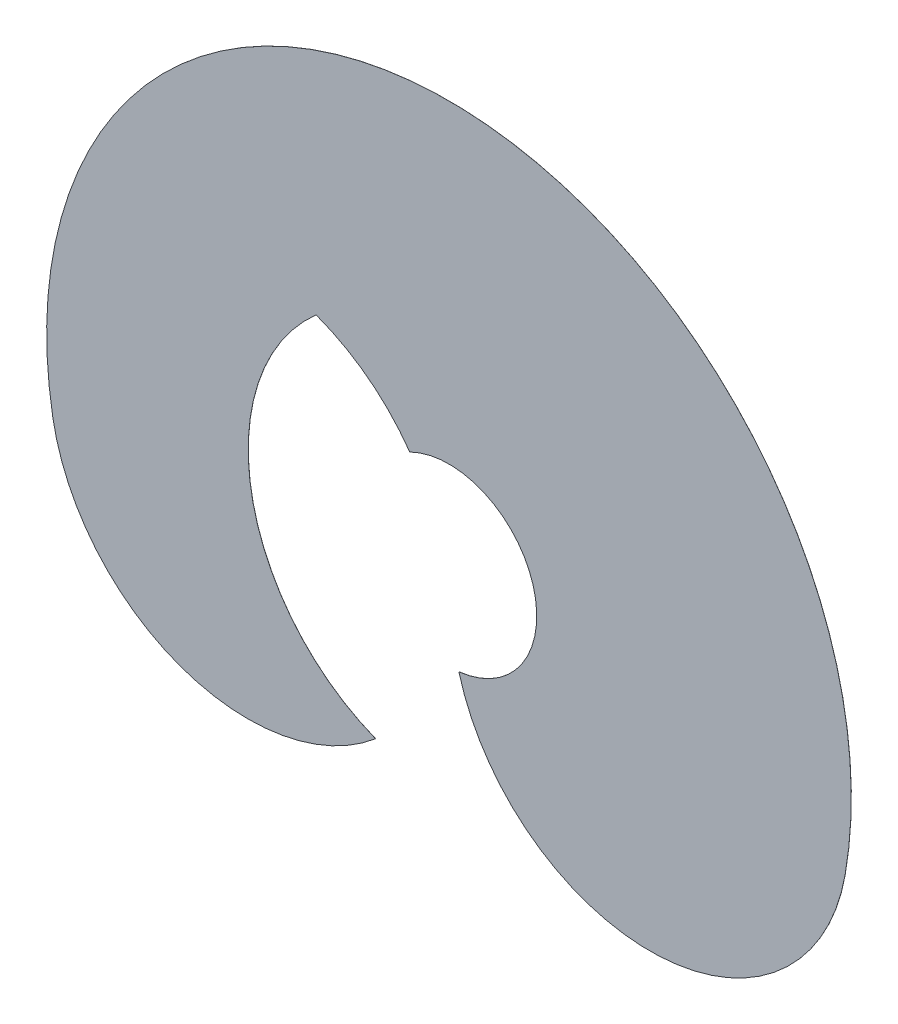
ISO-10303-21;
HEADER;
FILE_DESCRIPTION(('STEP AP214'),'2;1');
FILE_NAME('part.step','',(''),(''),'','','');
FILE_SCHEMA(('AUTOMOTIVE_DESIGN { 1 0 10303 214 1 1 1 1 }'));
ENDSEC;
DATA;
#1=APPLICATION_CONTEXT('core data for automotive mechanical design processes');
#2=APPLICATION_PROTOCOL_DEFINITION('international standard','automotive_design',2000,#1);
#3=PRODUCT_CONTEXT('',#1,'mechanical');
#4=PRODUCT('Part','Part','',(#3));
#5=PRODUCT_RELATED_PRODUCT_CATEGORY('part','',(#4));
#6=PRODUCT_DEFINITION_FORMATION('','',#4);
#7=PRODUCT_DEFINITION_CONTEXT('part definition',#1,'design');
#8=PRODUCT_DEFINITION('design','',#6,#7);
#9=PRODUCT_DEFINITION_SHAPE('','',#8);
#10=(LENGTH_UNIT() NAMED_UNIT(*) SI_UNIT(.MILLI.,.METRE.));
#11=(NAMED_UNIT(*) PLANE_ANGLE_UNIT() SI_UNIT($,.RADIAN.));
#12=(NAMED_UNIT(*) SI_UNIT($,.STERADIAN.) SOLID_ANGLE_UNIT());
#13=UNCERTAINTY_MEASURE_WITH_UNIT(LENGTH_MEASURE(1.E-05),#10,'distance_accuracy_value','');
#14=(GEOMETRIC_REPRESENTATION_CONTEXT(3) GLOBAL_UNCERTAINTY_ASSIGNED_CONTEXT((#13)) GLOBAL_UNIT_ASSIGNED_CONTEXT((#10,
#11,#12)) REPRESENTATION_CONTEXT('',''));
#15=CARTESIAN_POINT('',(0.,0.,0.));
#16=DIRECTION('',(0.,0.,1.));
#17=DIRECTION('',(1.,0.,0.));
#18=AXIS2_PLACEMENT_3D('',#15,#16,#17);
#19=CARTESIAN_POINT('',(250.,610.5,0.5));
#20=DIRECTION('',(0.,0.,-1.));
#21=DIRECTION('',(-1.,0.,0.));
#22=AXIS2_PLACEMENT_3D('',#19,#20,#21);
#23=CYLINDRICAL_SURFACE('',#22,1150.15105236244);
#24=CARTESIAN_POINT('',(250.,610.5,0.));
#25=DIRECTION('',(0.,0.,-1.));
#26=DIRECTION('',(1.,0.,0.));
#27=AXIS2_PLACEMENT_3D('',#24,#25,#26);
#28=CIRCLE('',#27,1150.15105236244);
#29=CARTESIAN_POINT('',(-170.519990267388,-460.018743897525,0.));
#30=VERTEX_POINT('',#29);
#31=CARTESIAN_POINT('',(-511.298505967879,1472.63225671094,0.));
#32=VERTEX_POINT('',#31);
#33=EDGE_CURVE('E117',#30,#32,#28,.T.);
#34=ORIENTED_EDGE('',*,*,#33,.T.);
#35=DIRECTION('',(0.,0.,-1.));
#36=VECTOR('',#35,1.);
#37=CARTESIAN_POINT('',(-511.298505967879,1472.63225671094,0.5));
#38=LINE('',#37,#36);
#39=CARTESIAN_POINT('',(-511.298505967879,1472.63225671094,0.5));
#40=VERTEX_POINT('',#39);
#41=EDGE_CURVE('E11',#40,#32,#38,.T.);
#42=ORIENTED_EDGE('',*,*,#41,.F.);
#43=CARTESIAN_POINT('',(250.,610.5,0.5));
#44=DIRECTION('',(0.,0.,-1.));
#45=DIRECTION('',(1.,0.,0.));
#46=AXIS2_PLACEMENT_3D('',#43,#44,#45);
#47=CIRCLE('',#46,1150.15105236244);
#48=CARTESIAN_POINT('',(-170.519990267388,-460.018743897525,0.5));
#49=VERTEX_POINT('',#48);
#50=EDGE_CURVE('E127',#49,#40,#47,.T.);
#51=ORIENTED_EDGE('',*,*,#50,.F.);
#52=DIRECTION('',(0.,0.,-1.));
#53=VECTOR('',#52,1.);
#54=CARTESIAN_POINT('',(-170.519990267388,-460.018743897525,0.5));
#55=LINE('',#54,#53);
#56=EDGE_CURVE('E113',#49,#30,#55,.T.);
#57=ORIENTED_EDGE('',*,*,#56,.T.);
#58=EDGE_LOOP('',(#34,#42,#51,#57));
#59=FACE_BOUND('',#58,.T.);
#60=ADVANCED_FACE('F33',(#59),#23,.F.);
#61=CARTESIAN_POINT('',(-902.225071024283,407.331632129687,0.5));
#62=DIRECTION('',(0.,0.,-1.));
#63=DIRECTION('',(-1.,0.,0.));
#64=AXIS2_PLACEMENT_3D('',#61,#62,#63);
#65=CYLINDRICAL_SURFACE('',#64,1134.76385208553);
#66=CARTESIAN_POINT('',(-902.225071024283,407.331632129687,0.));
#67=DIRECTION('',(0.,0.,-1.));
#68=DIRECTION('',(1.,0.,0.));
#69=AXIS2_PLACEMENT_3D('',#66,#67,#68);
#70=CIRCLE('',#69,1134.76385208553);
#71=CARTESIAN_POINT('',(25.5970747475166,1060.65778790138,0.));
#72=VERTEX_POINT('',#71);
#73=EDGE_CURVE('E120',#32,#72,#70,.T.);
#74=ORIENTED_EDGE('',*,*,#73,.T.);
#75=DIRECTION('',(0.,0.,-1.));
#76=VECTOR('',#75,1.);
#77=CARTESIAN_POINT('',(25.5970747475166,1060.65778790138,0.5));
#78=LINE('',#77,#76);
#79=CARTESIAN_POINT('',(25.5970747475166,1060.65778790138,0.5));
#80=VERTEX_POINT('',#79);
#81=EDGE_CURVE('E41',#80,#72,#78,.T.);
#82=ORIENTED_EDGE('',*,*,#81,.F.);
#83=CARTESIAN_POINT('',(-902.225071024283,407.331632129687,0.5));
#84=DIRECTION('',(0.,0.,-1.));
#85=DIRECTION('',(1.,0.,0.));
#86=AXIS2_PLACEMENT_3D('',#83,#84,#85);
#87=CIRCLE('',#86,1134.76385208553);
#88=EDGE_CURVE('E86',#40,#80,#87,.T.);
#89=ORIENTED_EDGE('',*,*,#88,.F.);
#90=ORIENTED_EDGE('',*,*,#41,.T.);
#91=EDGE_LOOP('',(#74,#82,#89,#90));
#92=FACE_BOUND('',#91,.T.);
#93=ADVANCED_FACE('F151',(#92),#65,.F.);
#94=CARTESIAN_POINT('',(250.,610.5,0.5));
#95=DIRECTION('',(0.,0.,-1.));
#96=DIRECTION('',(-1.,0.,0.));
#97=AXIS2_PLACEMENT_3D('',#94,#95,#96);
#98=CYLINDRICAL_SURFACE('',#97,502.989768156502);
#99=CARTESIAN_POINT('',(250.,610.5,0.));
#100=DIRECTION('',(0.,0.,-1.));
#101=DIRECTION('',(1.,0.,0.));
#102=AXIS2_PLACEMENT_3D('',#99,#100,#101);
#103=CIRCLE('',#102,502.989768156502);
#104=CARTESIAN_POINT('',(306.906741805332,110.739727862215,0.));
#105=VERTEX_POINT('',#104);
#106=EDGE_CURVE('E122',#72,#105,#103,.T.);
#107=ORIENTED_EDGE('',*,*,#106,.T.);
#108=DIRECTION('',(0.,0.,-1.));
#109=VECTOR('',#108,1.);
#110=CARTESIAN_POINT('',(306.906741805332,110.739727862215,0.5));
#111=LINE('',#110,#109);
#112=CARTESIAN_POINT('',(306.906741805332,110.739727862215,0.5));
#113=VERTEX_POINT('',#112);
#114=EDGE_CURVE('E108',#113,#105,#111,.T.);
#115=ORIENTED_EDGE('',*,*,#114,.F.);
#116=CARTESIAN_POINT('',(250.,610.5,0.5));
#117=DIRECTION('',(0.,0.,-1.));
#118=DIRECTION('',(1.,0.,0.));
#119=AXIS2_PLACEMENT_3D('',#116,#117,#118);
#120=CIRCLE('',#119,502.989768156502);
#121=EDGE_CURVE('E99',#80,#113,#120,.T.);
#122=ORIENTED_EDGE('',*,*,#121,.F.);
#123=ORIENTED_EDGE('',*,*,#81,.T.);
#124=EDGE_LOOP('',(#107,#115,#122,#123));
#125=FACE_BOUND('',#124,.T.);
#126=ADVANCED_FACE('F133',(#125),#98,.F.);
#127=CARTESIAN_POINT('',(1402.22507102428,407.331632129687,0.5));
#128=DIRECTION('',(0.,0.,-1.));
#129=DIRECTION('',(-1.,0.,0.));
#130=AXIS2_PLACEMENT_3D('',#127,#128,#129);
#131=CYLINDRICAL_SURFACE('',#130,1134.76385208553);
#132=CARTESIAN_POINT('',(1402.22507102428,407.331632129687,0.));
#133=DIRECTION('',(0.,0.,1.));
#134=DIRECTION('',(1.,0.,0.));
#135=AXIS2_PLACEMENT_3D('',#132,#133,#134);
#136=CIRCLE('',#135,1134.76385208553);
#137=CARTESIAN_POINT('',(2519.74931039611,210.281957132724,0.));
#138=VERTEX_POINT('',#137);
#139=EDGE_CURVE('E107',#105,#138,#136,.T.);
#140=ORIENTED_EDGE('',*,*,#139,.T.);
#141=DIRECTION('',(0.,0.,-1.));
#142=VECTOR('',#141,1.);
#143=CARTESIAN_POINT('',(2519.74931039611,210.281957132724,0.5));
#144=LINE('',#143,#142);
#145=CARTESIAN_POINT('',(2519.74931039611,210.281957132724,0.5));
#146=VERTEX_POINT('',#145);
#147=EDGE_CURVE('E104',#146,#138,#144,.T.);
#148=ORIENTED_EDGE('',*,*,#147,.F.);
#149=CARTESIAN_POINT('',(1402.22507102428,407.331632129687,0.5));
#150=DIRECTION('',(0.,0.,1.));
#151=DIRECTION('',(1.,0.,0.));
#152=AXIS2_PLACEMENT_3D('',#149,#150,#151);
#153=CIRCLE('',#152,1134.76385208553);
#154=EDGE_CURVE('E93',#113,#146,#153,.T.);
#155=ORIENTED_EDGE('',*,*,#154,.F.);
#156=ORIENTED_EDGE('',*,*,#114,.T.);
#157=EDGE_LOOP('',(#140,#148,#155,#156));
#158=FACE_BOUND('',#157,.T.);
#159=ADVANCED_FACE('F105',(#158),#131,.T.);
#160=CARTESIAN_POINT('',(250.,610.5,0.5));
#161=DIRECTION('',(0.,0.,-1.));
#162=DIRECTION('',(-1.,0.,0.));
#163=AXIS2_PLACEMENT_3D('',#160,#161,#162);
#164=CYLINDRICAL_SURFACE('',#163,2304.76385208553);
#165=CARTESIAN_POINT('',(250.,610.5,0.));
#166=DIRECTION('',(0.,0.,1.));
#167=DIRECTION('',(1.,0.,0.));
#168=AXIS2_PLACEMENT_3D('',#165,#166,#167);
#169=CIRCLE('',#168,2304.76385208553);
#170=CARTESIAN_POINT('',(-2019.74931039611,210.281957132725,0.));
#171=VERTEX_POINT('',#170);
#172=EDGE_CURVE('E72',#138,#171,#169,.T.);
#173=ORIENTED_EDGE('',*,*,#172,.T.);
#174=DIRECTION('',(0.,0.,-1.));
#175=VECTOR('',#174,1.);
#176=CARTESIAN_POINT('',(-2019.74931039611,210.281957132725,0.5));
#177=LINE('',#176,#175);
#178=CARTESIAN_POINT('',(-2019.74931039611,210.281957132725,0.5));
#179=VERTEX_POINT('',#178);
#180=EDGE_CURVE('E109',#179,#171,#177,.T.);
#181=ORIENTED_EDGE('',*,*,#180,.F.);
#182=CARTESIAN_POINT('',(250.,610.5,0.5));
#183=DIRECTION('',(0.,0.,1.));
#184=DIRECTION('',(1.,0.,0.));
#185=AXIS2_PLACEMENT_3D('',#182,#183,#184);
#186=CIRCLE('',#185,2304.76385208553);
#187=EDGE_CURVE('E97',#146,#179,#186,.T.);
#188=ORIENTED_EDGE('',*,*,#187,.F.);
#189=ORIENTED_EDGE('',*,*,#147,.T.);
#190=EDGE_LOOP('',(#173,#181,#188,#189));
#191=FACE_BOUND('',#190,.T.);
#192=ADVANCED_FACE('F111',(#191),#164,.T.);
#193=CARTESIAN_POINT('',(-902.225071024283,407.331632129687,0.5));
#194=DIRECTION('',(0.,0.,-1.));
#195=DIRECTION('',(-1.,0.,0.));
#196=AXIS2_PLACEMENT_3D('',#193,#194,#195);
#197=CYLINDRICAL_SURFACE('',#196,1134.76385208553);
#198=CARTESIAN_POINT('',(-902.225071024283,407.331632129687,0.));
#199=DIRECTION('',(0.,0.,1.));
#200=DIRECTION('',(1.,0.,0.));
#201=AXIS2_PLACEMENT_3D('',#198,#199,#200);
#202=CIRCLE('',#201,1134.76385208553);
#203=EDGE_CURVE('E78',#171,#30,#202,.T.);
#204=ORIENTED_EDGE('',*,*,#203,.T.);
#205=ORIENTED_EDGE('',*,*,#56,.F.);
#206=CARTESIAN_POINT('',(-902.225071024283,407.331632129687,0.5));
#207=DIRECTION('',(0.,0.,1.));
#208=DIRECTION('',(1.,0.,0.));
#209=AXIS2_PLACEMENT_3D('',#206,#207,#208);
#210=CIRCLE('',#209,1134.76385208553);
#211=EDGE_CURVE('E49',#179,#49,#210,.T.);
#212=ORIENTED_EDGE('',*,*,#211,.F.);
#213=ORIENTED_EDGE('',*,*,#180,.T.);
#214=EDGE_LOOP('',(#204,#205,#212,#213));
#215=FACE_BOUND('',#214,.T.);
#216=ADVANCED_FACE('F140',(#215),#197,.T.);
#217=CARTESIAN_POINT('',(-326.112535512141,508.915816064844,0.5));
#218=DIRECTION('',(0.,0.,1.));
#219=DIRECTION('',(1.,0.,0.));
#220=AXIS2_PLACEMENT_3D('',#217,#218,#219);
#221=PLANE('',#220);
#222=ORIENTED_EDGE('',*,*,#50,.T.);
#223=ORIENTED_EDGE('',*,*,#88,.T.);
#224=ORIENTED_EDGE('',*,*,#121,.T.);
#225=ORIENTED_EDGE('',*,*,#154,.T.);
#226=ORIENTED_EDGE('',*,*,#187,.T.);
#227=ORIENTED_EDGE('',*,*,#211,.T.);
#228=EDGE_LOOP('',(#222,#223,#224,#225,#226,#227));
#229=FACE_BOUND('',#228,.T.);
#230=ADVANCED_FACE('F95',(#229),#221,.T.);
#231=CARTESIAN_POINT('',(-326.112535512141,508.915816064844,0.));
#232=DIRECTION('',(0.,0.,1.));
#233=DIRECTION('',(1.,0.,0.));
#234=AXIS2_PLACEMENT_3D('',#231,#232,#233);
#235=PLANE('',#234);
#236=ORIENTED_EDGE('',*,*,#33,.F.);
#237=ORIENTED_EDGE('',*,*,#203,.F.);
#238=ORIENTED_EDGE('',*,*,#172,.F.);
#239=ORIENTED_EDGE('',*,*,#139,.F.);
#240=ORIENTED_EDGE('',*,*,#106,.F.);
#241=ORIENTED_EDGE('',*,*,#73,.F.);
#242=EDGE_LOOP('',(#236,#237,#238,#239,#240,#241));
#243=FACE_BOUND('',#242,.T.);
#244=ADVANCED_FACE('F136',(#243),#235,.F.);
#245=CLOSED_SHELL('',(#60,#93,#126,#159,#192,#216,#230,#244));
#246=MANIFOLD_SOLID_BREP('B2',#245);
#247=ADVANCED_BREP_SHAPE_REPRESENTATION('',(#18,#246),#14);
#248=SHAPE_DEFINITION_REPRESENTATION(#9,#247);
ENDSEC;
END-ISO-10303-21;
